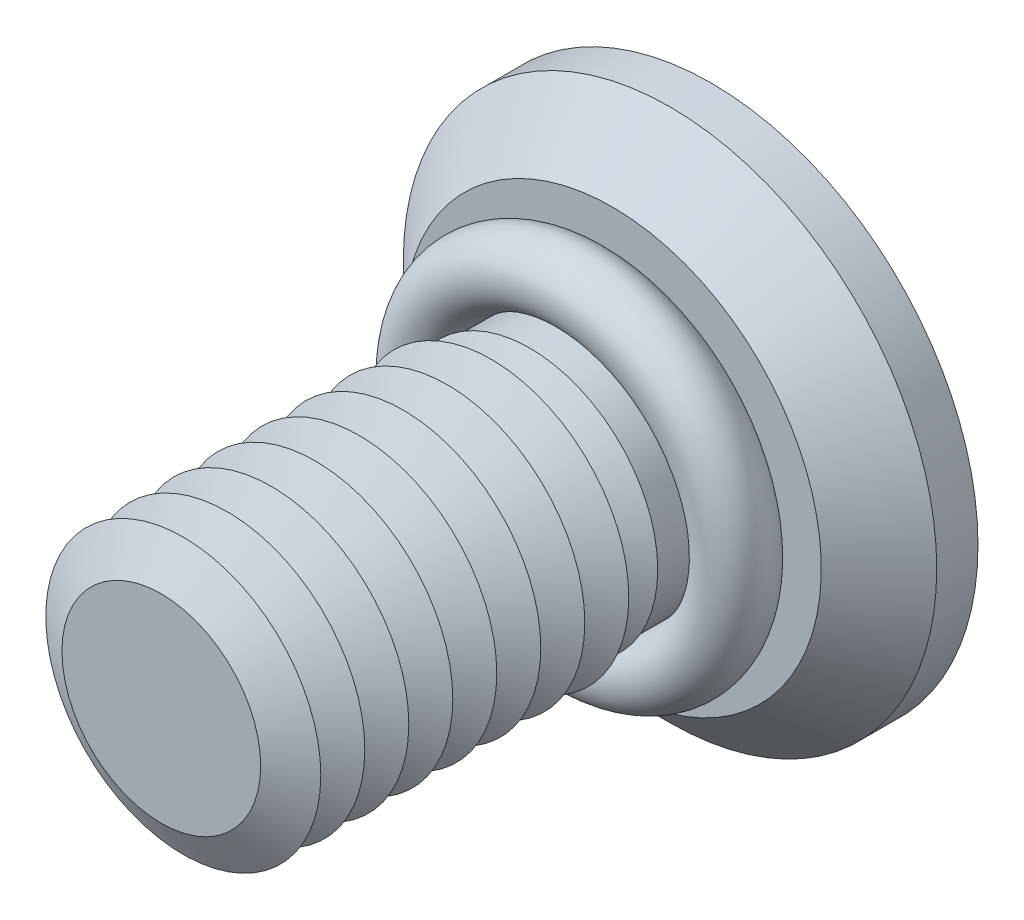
ISO-10303-21;
HEADER;
FILE_DESCRIPTION(('STEP AP214'),'2;1');
FILE_NAME('part.step','',(''),(''),'','','');
FILE_SCHEMA(('AUTOMOTIVE_DESIGN { 1 0 10303 214 1 1 1 1 }'));
ENDSEC;
DATA;
#1=APPLICATION_CONTEXT('core data for automotive mechanical design processes');
#2=APPLICATION_PROTOCOL_DEFINITION('international standard','automotive_design',2000,#1);
#3=PRODUCT_CONTEXT('',#1,'mechanical');
#4=PRODUCT('Part','Part','',(#3));
#5=PRODUCT_RELATED_PRODUCT_CATEGORY('part','',(#4));
#6=PRODUCT_DEFINITION_FORMATION('','',#4);
#7=PRODUCT_DEFINITION_CONTEXT('part definition',#1,'design');
#8=PRODUCT_DEFINITION('design','',#6,#7);
#9=PRODUCT_DEFINITION_SHAPE('','',#8);
#10=(LENGTH_UNIT() NAMED_UNIT(*) SI_UNIT(.MILLI.,.METRE.));
#11=(NAMED_UNIT(*) PLANE_ANGLE_UNIT() SI_UNIT($,.RADIAN.));
#12=(NAMED_UNIT(*) SI_UNIT($,.STERADIAN.) SOLID_ANGLE_UNIT());
#13=UNCERTAINTY_MEASURE_WITH_UNIT(LENGTH_MEASURE(1.E-05),#10,'distance_accuracy_value','');
#14=(GEOMETRIC_REPRESENTATION_CONTEXT(3) GLOBAL_UNCERTAINTY_ASSIGNED_CONTEXT((#13)) GLOBAL_UNIT_ASSIGNED_CONTEXT((#10,
#11,#12)) REPRESENTATION_CONTEXT('',''));
#15=CARTESIAN_POINT('',(0.,0.,0.));
#16=DIRECTION('',(0.,0.,1.));
#17=DIRECTION('',(1.,0.,0.));
#18=AXIS2_PLACEMENT_3D('',#15,#16,#17);
#19=CARTESIAN_POINT('',(0.,0.,2.4));
#20=DIRECTION('',(0.,0.,1.));
#21=DIRECTION('',(1.,0.,0.));
#22=AXIS2_PLACEMENT_3D('',#19,#20,#21);
#23=TOROIDAL_SURFACE('',#22,2.85,0.6);
#24=CARTESIAN_POINT('',(0.,2.85,2.4));
#25=DIRECTION('',(1.,0.,0.));
#26=DIRECTION('',(0.,0.,-1.));
#27=AXIS2_PLACEMENT_3D('',#24,#25,#26);
#28=CIRCLE('',#27,0.6);
#29=CARTESIAN_POINT('',(0.,3.45,2.4));
#30=VERTEX_POINT('',#29);
#31=EDGE_CURVE('P0_E10',#30,#30,#28,.T.);
#32=CARTESIAN_POINT('',(0.,0.,2.4));
#33=DIRECTION('',(0.,0.,1.));
#34=DIRECTION('',(1.,0.,0.));
#35=AXIS2_PLACEMENT_3D('',#32,#33,#34);
#36=CIRCLE('',#35,3.45);
#37=EDGE_CURVE('',#30,#30,#36,.T.);
#38=ORIENTED_EDGE('',*,*,#31,.F.);
#39=ORIENTED_EDGE('',*,*,#31,.T.);
#40=ORIENTED_EDGE('',*,*,#37,.T.);
#41=ORIENTED_EDGE('',*,*,#37,.F.);
#42=EDGE_LOOP('',(#38,#40,#39,#41));
#43=FACE_BOUND('',#42,.T.);
#44=ADVANCED_FACE('P0_F14',(#43),#23,.T.);
#45=CLOSED_SHELL('',(#44));
#46=MANIFOLD_SOLID_BREP('P0_B1',#45);
#47=CARTESIAN_POINT('',(0.,0.,6.));
#48=DIRECTION('',(0.,0.,-1.));
#49=DIRECTION('',(-1.,0.,0.));
#50=AXIS2_PLACEMENT_3D('',#47,#48,#49);
#51=CONICAL_SURFACE('',#50,1.80717967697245,1.0471975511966);
#52=CARTESIAN_POINT('',(0.,0.,5.6));
#53=DIRECTION('',(0.,0.,1.));
#54=DIRECTION('',(1.,0.,0.));
#55=AXIS2_PLACEMENT_3D('',#52,#53,#54);
#56=CIRCLE('',#55,2.5);
#57=CARTESIAN_POINT('',(2.5,0.,5.6));
#58=VERTEX_POINT('',#57);
#59=EDGE_CURVE('P1_E330',#58,#58,#56,.T.);
#60=ORIENTED_EDGE('',*,*,#59,.T.);
#61=EDGE_LOOP('',(#60));
#62=FACE_BOUND('',#61,.T.);
#63=CARTESIAN_POINT('',(0.,0.,6.));
#64=DIRECTION('',(0.,0.,1.));
#65=DIRECTION('',(1.,0.,0.));
#66=AXIS2_PLACEMENT_3D('',#63,#64,#65);
#67=CIRCLE('',#66,1.80717967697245);
#68=CARTESIAN_POINT('',(1.80717967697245,0.,6.));
#69=VERTEX_POINT('',#68);
#70=EDGE_CURVE('P1_E327',#69,#69,#67,.T.);
#71=ORIENTED_EDGE('',*,*,#70,.F.);
#72=EDGE_LOOP('',(#71));
#73=FACE_BOUND('',#72,.T.);
#74=ADVANCED_FACE('P1_F15',(#62,#73),#51,.T.);
#75=CARTESIAN_POINT('',(0.,0.,6.4));
#76=DIRECTION('',(0.,0.,1.));
#77=DIRECTION('',(1.,0.,0.));
#78=AXIS2_PLACEMENT_3D('',#75,#76,#77);
#79=CONICAL_SURFACE('',#78,2.5,1.0471975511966);
#80=ORIENTED_EDGE('',*,*,#70,.T.);
#81=EDGE_LOOP('',(#80));
#82=FACE_BOUND('',#81,.T.);
#83=CARTESIAN_POINT('',(0.,0.,6.4));
#84=DIRECTION('',(0.,0.,1.));
#85=DIRECTION('',(1.,0.,0.));
#86=AXIS2_PLACEMENT_3D('',#83,#84,#85);
#87=CIRCLE('',#86,2.5);
#88=CARTESIAN_POINT('',(2.5,0.,6.4));
#89=VERTEX_POINT('',#88);
#90=EDGE_CURVE('P1_E324',#89,#89,#87,.T.);
#91=ORIENTED_EDGE('',*,*,#90,.F.);
#92=EDGE_LOOP('',(#91));
#93=FACE_BOUND('',#92,.T.);
#94=ADVANCED_FACE('P1_F249',(#82,#93),#79,.T.);
#95=CARTESIAN_POINT('',(0.,0.,10.));
#96=DIRECTION('',(0.,0.,1.));
#97=DIRECTION('',(1.,0.,0.));
#98=AXIS2_PLACEMENT_3D('',#95,#96,#97);
#99=PLANE('',#98);
#100=CARTESIAN_POINT('',(0.,0.,10.));
#101=DIRECTION('',(0.,0.,1.));
#102=DIRECTION('',(1.,0.,0.));
#103=AXIS2_PLACEMENT_3D('',#100,#101,#102);
#104=CIRCLE('',#103,1.80717967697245);
#105=CARTESIAN_POINT('',(1.80717967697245,0.,10.));
#106=VERTEX_POINT('',#105);
#107=EDGE_CURVE('P1_E131',#106,#106,#104,.T.);
#108=ORIENTED_EDGE('',*,*,#107,.T.);
#109=EDGE_LOOP('',(#108));
#110=FACE_BOUND('',#109,.T.);
#111=ADVANCED_FACE('P1_F257',(#110),#99,.T.);
#112=CARTESIAN_POINT('',(0.,0.,10.));
#113=DIRECTION('',(0.,0.,-1.));
#114=DIRECTION('',(-1.,0.,0.));
#115=AXIS2_PLACEMENT_3D('',#112,#113,#114);
#116=CONICAL_SURFACE('',#115,1.80717967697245,1.0471975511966);
#117=CARTESIAN_POINT('',(0.,0.,9.6));
#118=DIRECTION('',(0.,0.,1.));
#119=DIRECTION('',(1.,0.,0.));
#120=AXIS2_PLACEMENT_3D('',#117,#118,#119);
#121=CIRCLE('',#120,2.5);
#122=CARTESIAN_POINT('',(2.5,0.,9.6));
#123=VERTEX_POINT('',#122);
#124=EDGE_CURVE('P1_E133',#123,#123,#121,.T.);
#125=ORIENTED_EDGE('',*,*,#124,.T.);
#126=EDGE_LOOP('',(#125));
#127=FACE_BOUND('',#126,.T.);
#128=ORIENTED_EDGE('',*,*,#107,.F.);
#129=EDGE_LOOP('',(#128));
#130=FACE_BOUND('',#129,.T.);
#131=ADVANCED_FACE('P1_F199',(#127,#130),#116,.T.);
#132=CARTESIAN_POINT('',(0.,0.,9.6));
#133=DIRECTION('',(0.,0.,1.));
#134=DIRECTION('',(1.,0.,0.));
#135=AXIS2_PLACEMENT_3D('',#132,#133,#134);
#136=CONICAL_SURFACE('',#135,2.5,1.0471975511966);
#137=CARTESIAN_POINT('',(0.,0.,9.2));
#138=DIRECTION('',(0.,0.,1.));
#139=DIRECTION('',(1.,0.,0.));
#140=AXIS2_PLACEMENT_3D('',#137,#138,#139);
#141=CIRCLE('',#140,1.80717967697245);
#142=CARTESIAN_POINT('',(1.80717967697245,0.,9.2));
#143=VERTEX_POINT('',#142);
#144=EDGE_CURVE('P1_E303',#143,#143,#141,.T.);
#145=ORIENTED_EDGE('',*,*,#144,.T.);
#146=EDGE_LOOP('',(#145));
#147=FACE_BOUND('',#146,.T.);
#148=ORIENTED_EDGE('',*,*,#124,.F.);
#149=EDGE_LOOP('',(#148));
#150=FACE_BOUND('',#149,.T.);
#151=ADVANCED_FACE('P1_F290',(#147,#150),#136,.T.);
#152=CARTESIAN_POINT('',(0.,0.,9.2));
#153=DIRECTION('',(0.,0.,-1.));
#154=DIRECTION('',(-1.,0.,0.));
#155=AXIS2_PLACEMENT_3D('',#152,#153,#154);
#156=CONICAL_SURFACE('',#155,1.80717967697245,1.0471975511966);
#157=CARTESIAN_POINT('',(0.,0.,8.8));
#158=DIRECTION('',(0.,0.,1.));
#159=DIRECTION('',(1.,0.,0.));
#160=AXIS2_PLACEMENT_3D('',#157,#158,#159);
#161=CIRCLE('',#160,2.5);
#162=CARTESIAN_POINT('',(2.5,0.,8.8));
#163=VERTEX_POINT('',#162);
#164=EDGE_CURVE('P1_E300',#163,#163,#161,.T.);
#165=ORIENTED_EDGE('',*,*,#164,.T.);
#166=EDGE_LOOP('',(#165));
#167=FACE_BOUND('',#166,.T.);
#168=ORIENTED_EDGE('',*,*,#144,.F.);
#169=EDGE_LOOP('',(#168));
#170=FACE_BOUND('',#169,.T.);
#171=ADVANCED_FACE('P1_F285',(#167,#170),#156,.T.);
#172=CARTESIAN_POINT('',(0.,0.,8.8));
#173=DIRECTION('',(0.,0.,1.));
#174=DIRECTION('',(1.,0.,0.));
#175=AXIS2_PLACEMENT_3D('',#172,#173,#174);
#176=CONICAL_SURFACE('',#175,2.5,1.0471975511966);
#177=CARTESIAN_POINT('',(0.,0.,8.4));
#178=DIRECTION('',(0.,0.,1.));
#179=DIRECTION('',(1.,0.,0.));
#180=AXIS2_PLACEMENT_3D('',#177,#178,#179);
#181=CIRCLE('',#180,1.80717967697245);
#182=CARTESIAN_POINT('',(1.80717967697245,0.,8.4));
#183=VERTEX_POINT('',#182);
#184=EDGE_CURVE('P1_E307',#183,#183,#181,.T.);
#185=ORIENTED_EDGE('',*,*,#184,.T.);
#186=EDGE_LOOP('',(#185));
#187=FACE_BOUND('',#186,.T.);
#188=ORIENTED_EDGE('',*,*,#164,.F.);
#189=EDGE_LOOP('',(#188));
#190=FACE_BOUND('',#189,.T.);
#191=ADVANCED_FACE('P1_F282',(#187,#190),#176,.T.);
#192=CARTESIAN_POINT('',(0.,0.,8.4));
#193=DIRECTION('',(0.,0.,-1.));
#194=DIRECTION('',(-1.,0.,0.));
#195=AXIS2_PLACEMENT_3D('',#192,#193,#194);
#196=CONICAL_SURFACE('',#195,1.80717967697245,1.0471975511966);
#197=CARTESIAN_POINT('',(0.,0.,8.));
#198=DIRECTION('',(0.,0.,1.));
#199=DIRECTION('',(1.,0.,0.));
#200=AXIS2_PLACEMENT_3D('',#197,#198,#199);
#201=CIRCLE('',#200,2.5);
#202=CARTESIAN_POINT('',(2.5,0.,8.));
#203=VERTEX_POINT('',#202);
#204=EDGE_CURVE('P1_E312',#203,#203,#201,.T.);
#205=ORIENTED_EDGE('',*,*,#204,.T.);
#206=EDGE_LOOP('',(#205));
#207=FACE_BOUND('',#206,.T.);
#208=ORIENTED_EDGE('',*,*,#184,.F.);
#209=EDGE_LOOP('',(#208));
#210=FACE_BOUND('',#209,.T.);
#211=ADVANCED_FACE('P1_F277',(#207,#210),#196,.T.);
#212=CARTESIAN_POINT('',(0.,0.,8.));
#213=DIRECTION('',(0.,0.,1.));
#214=DIRECTION('',(1.,0.,0.));
#215=AXIS2_PLACEMENT_3D('',#212,#213,#214);
#216=CONICAL_SURFACE('',#215,2.5,1.0471975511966);
#217=CARTESIAN_POINT('',(0.,0.,7.6));
#218=DIRECTION('',(0.,0.,1.));
#219=DIRECTION('',(1.,0.,0.));
#220=AXIS2_PLACEMENT_3D('',#217,#218,#219);
#221=CIRCLE('',#220,1.80717967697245);
#222=CARTESIAN_POINT('',(1.80717967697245,0.,7.6));
#223=VERTEX_POINT('',#222);
#224=EDGE_CURVE('P1_E315',#223,#223,#221,.T.);
#225=ORIENTED_EDGE('',*,*,#224,.T.);
#226=EDGE_LOOP('',(#225));
#227=FACE_BOUND('',#226,.T.);
#228=ORIENTED_EDGE('',*,*,#204,.F.);
#229=EDGE_LOOP('',(#228));
#230=FACE_BOUND('',#229,.T.);
#231=ADVANCED_FACE('P1_F274',(#227,#230),#216,.T.);
#232=CARTESIAN_POINT('',(0.,0.,7.6));
#233=DIRECTION('',(0.,0.,-1.));
#234=DIRECTION('',(-1.,0.,0.));
#235=AXIS2_PLACEMENT_3D('',#232,#233,#234);
#236=CONICAL_SURFACE('',#235,1.80717967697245,1.0471975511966);
#237=CARTESIAN_POINT('',(0.,0.,7.2));
#238=DIRECTION('',(0.,0.,1.));
#239=DIRECTION('',(1.,0.,0.));
#240=AXIS2_PLACEMENT_3D('',#237,#238,#239);
#241=CIRCLE('',#240,2.5);
#242=CARTESIAN_POINT('',(2.5,0.,7.2));
#243=VERTEX_POINT('',#242);
#244=EDGE_CURVE('P1_E318',#243,#243,#241,.T.);
#245=ORIENTED_EDGE('',*,*,#244,.T.);
#246=EDGE_LOOP('',(#245));
#247=FACE_BOUND('',#246,.T.);
#248=ORIENTED_EDGE('',*,*,#224,.F.);
#249=EDGE_LOOP('',(#248));
#250=FACE_BOUND('',#249,.T.);
#251=ADVANCED_FACE('P1_F268',(#247,#250),#236,.T.);
#252=CARTESIAN_POINT('',(0.,0.,7.2));
#253=DIRECTION('',(0.,0.,1.));
#254=DIRECTION('',(1.,0.,0.));
#255=AXIS2_PLACEMENT_3D('',#252,#253,#254);
#256=CONICAL_SURFACE('',#255,2.5,1.0471975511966);
#257=CARTESIAN_POINT('',(0.,0.,6.8));
#258=DIRECTION('',(0.,0.,1.));
#259=DIRECTION('',(1.,0.,0.));
#260=AXIS2_PLACEMENT_3D('',#257,#258,#259);
#261=CIRCLE('',#260,1.80717967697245);
#262=CARTESIAN_POINT('',(1.80717967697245,0.,6.8));
#263=VERTEX_POINT('',#262);
#264=EDGE_CURVE('P1_E321',#263,#263,#261,.T.);
#265=ORIENTED_EDGE('',*,*,#264,.T.);
#266=EDGE_LOOP('',(#265));
#267=FACE_BOUND('',#266,.T.);
#268=ORIENTED_EDGE('',*,*,#244,.F.);
#269=EDGE_LOOP('',(#268));
#270=FACE_BOUND('',#269,.T.);
#271=ADVANCED_FACE('P1_F264',(#267,#270),#256,.T.);
#272=CARTESIAN_POINT('',(0.,0.,6.8));
#273=DIRECTION('',(0.,0.,-1.));
#274=DIRECTION('',(-1.,0.,0.));
#275=AXIS2_PLACEMENT_3D('',#272,#273,#274);
#276=CONICAL_SURFACE('',#275,1.80717967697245,1.0471975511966);
#277=ORIENTED_EDGE('',*,*,#90,.T.);
#278=EDGE_LOOP('',(#277));
#279=FACE_BOUND('',#278,.T.);
#280=ORIENTED_EDGE('',*,*,#264,.F.);
#281=EDGE_LOOP('',(#280));
#282=FACE_BOUND('',#281,.T.);
#283=ADVANCED_FACE('P1_F267',(#279,#282),#276,.T.);
#284=CARTESIAN_POINT('',(0.,0.,5.2));
#285=DIRECTION('',(0.,0.,-1.));
#286=DIRECTION('',(-1.,0.,0.));
#287=AXIS2_PLACEMENT_3D('',#284,#285,#286);
#288=CONICAL_SURFACE('',#287,1.80717967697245,1.0471975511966);
#289=CARTESIAN_POINT('',(0.,0.,4.8));
#290=DIRECTION('',(0.,0.,1.));
#291=DIRECTION('',(1.,0.,0.));
#292=AXIS2_PLACEMENT_3D('',#289,#290,#291);
#293=CIRCLE('',#292,2.5);
#294=CARTESIAN_POINT('',(2.5,0.,4.8));
#295=VERTEX_POINT('',#294);
#296=EDGE_CURVE('P1_E335',#295,#295,#293,.T.);
#297=ORIENTED_EDGE('',*,*,#296,.T.);
#298=EDGE_LOOP('',(#297));
#299=FACE_BOUND('',#298,.T.);
#300=CARTESIAN_POINT('',(0.,0.,5.2));
#301=DIRECTION('',(0.,0.,1.));
#302=DIRECTION('',(1.,0.,0.));
#303=AXIS2_PLACEMENT_3D('',#300,#301,#302);
#304=CIRCLE('',#303,1.80717967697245);
#305=CARTESIAN_POINT('',(1.80717967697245,0.,5.2));
#306=VERTEX_POINT('',#305);
#307=EDGE_CURVE('P1_E332',#306,#306,#304,.T.);
#308=ORIENTED_EDGE('',*,*,#307,.F.);
#309=EDGE_LOOP('',(#308));
#310=FACE_BOUND('',#309,.T.);
#311=ADVANCED_FACE('P1_F272',(#299,#310),#288,.T.);
#312=CARTESIAN_POINT('',(0.,0.,5.6));
#313=DIRECTION('',(0.,0.,1.));
#314=DIRECTION('',(1.,0.,0.));
#315=AXIS2_PLACEMENT_3D('',#312,#313,#314);
#316=CONICAL_SURFACE('',#315,2.5,1.0471975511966);
#317=ORIENTED_EDGE('',*,*,#307,.T.);
#318=EDGE_LOOP('',(#317));
#319=FACE_BOUND('',#318,.T.);
#320=ORIENTED_EDGE('',*,*,#59,.F.);
#321=EDGE_LOOP('',(#320));
#322=FACE_BOUND('',#321,.T.);
#323=ADVANCED_FACE('P1_F451',(#319,#322),#316,.T.);
#324=CARTESIAN_POINT('',(0.,0.,4.4));
#325=DIRECTION('',(0.,0.,-1.));
#326=DIRECTION('',(-1.,0.,0.));
#327=AXIS2_PLACEMENT_3D('',#324,#325,#326);
#328=CONICAL_SURFACE('',#327,1.80717967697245,1.0471975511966);
#329=CARTESIAN_POINT('',(0.,0.,4.));
#330=DIRECTION('',(0.,0.,1.));
#331=DIRECTION('',(1.,0.,0.));
#332=AXIS2_PLACEMENT_3D('',#329,#330,#331);
#333=CIRCLE('',#332,2.5);
#334=CARTESIAN_POINT('',(2.5,0.,4.));
#335=VERTEX_POINT('',#334);
#336=EDGE_CURVE('P1_E341',#335,#335,#333,.T.);
#337=ORIENTED_EDGE('',*,*,#336,.T.);
#338=EDGE_LOOP('',(#337));
#339=FACE_BOUND('',#338,.T.);
#340=CARTESIAN_POINT('',(0.,0.,4.4));
#341=DIRECTION('',(0.,0.,1.));
#342=DIRECTION('',(1.,0.,0.));
#343=AXIS2_PLACEMENT_3D('',#340,#341,#342);
#344=CIRCLE('',#343,1.80717967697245);
#345=CARTESIAN_POINT('',(1.80717967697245,0.,4.4));
#346=VERTEX_POINT('',#345);
#347=EDGE_CURVE('P1_E338',#346,#346,#344,.T.);
#348=ORIENTED_EDGE('',*,*,#347,.F.);
#349=EDGE_LOOP('',(#348));
#350=FACE_BOUND('',#349,.T.);
#351=ADVANCED_FACE('P1_F460',(#339,#350),#328,.T.);
#352=CARTESIAN_POINT('',(0.,0.,4.8));
#353=DIRECTION('',(0.,0.,1.));
#354=DIRECTION('',(1.,0.,0.));
#355=AXIS2_PLACEMENT_3D('',#352,#353,#354);
#356=CONICAL_SURFACE('',#355,2.5,1.0471975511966);
#357=ORIENTED_EDGE('',*,*,#347,.T.);
#358=EDGE_LOOP('',(#357));
#359=FACE_BOUND('',#358,.T.);
#360=ORIENTED_EDGE('',*,*,#296,.F.);
#361=EDGE_LOOP('',(#360));
#362=FACE_BOUND('',#361,.T.);
#363=ADVANCED_FACE('P1_F354',(#359,#362),#356,.T.);
#364=CARTESIAN_POINT('',(0.,0.,3.6));
#365=DIRECTION('',(0.,0.,-1.));
#366=DIRECTION('',(-1.,0.,0.));
#367=AXIS2_PLACEMENT_3D('',#364,#365,#366);
#368=CONICAL_SURFACE('',#367,1.80717967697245,1.0471975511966);
#369=CARTESIAN_POINT('',(0.,0.,3.6));
#370=DIRECTION('',(0.,0.,1.));
#371=DIRECTION('',(1.,0.,0.));
#372=AXIS2_PLACEMENT_3D('',#369,#370,#371);
#373=CIRCLE('',#372,1.80717967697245);
#374=CARTESIAN_POINT('',(1.80717967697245,0.,3.6));
#375=VERTEX_POINT('',#374);
#376=EDGE_CURVE('P1_E344',#375,#375,#373,.T.);
#377=ORIENTED_EDGE('',*,*,#376,.F.);
#378=EDGE_LOOP('',(#377));
#379=FACE_BOUND('',#378,.T.);
#380=CARTESIAN_POINT('',(0.,0.,3.3));
#381=DIRECTION('',(0.,0.,1.));
#382=DIRECTION('',(1.,0.,0.));
#383=AXIS2_PLACEMENT_3D('',#380,#381,#382);
#384=CIRCLE('',#383,2.32679491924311);
#385=CARTESIAN_POINT('',(2.32679491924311,0.,3.3));
#386=VERTEX_POINT('',#385);
#387=EDGE_CURVE('P1_E19',#386,#386,#384,.T.);
#388=ORIENTED_EDGE('',*,*,#387,.T.);
#389=EDGE_LOOP('',(#388));
#390=FACE_BOUND('',#389,.T.);
#391=ADVANCED_FACE('P1_F351',(#379,#390),#368,.T.);
#392=CARTESIAN_POINT('',(0.,0.,4.));
#393=DIRECTION('',(0.,0.,1.));
#394=DIRECTION('',(1.,0.,0.));
#395=AXIS2_PLACEMENT_3D('',#392,#393,#394);
#396=CONICAL_SURFACE('',#395,2.5,1.0471975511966);
#397=ORIENTED_EDGE('',*,*,#376,.T.);
#398=EDGE_LOOP('',(#397));
#399=FACE_BOUND('',#398,.T.);
#400=ORIENTED_EDGE('',*,*,#336,.F.);
#401=EDGE_LOOP('',(#400));
#402=FACE_BOUND('',#401,.T.);
#403=ADVANCED_FACE('P1_F348',(#399,#402),#396,.T.);
#404=CARTESIAN_POINT('',(0.,0.,2.));
#405=DIRECTION('',(0.,0.,-1.));
#406=DIRECTION('',(-1.,0.,0.));
#407=AXIS2_PLACEMENT_3D('',#404,#405,#406);
#408=CONICAL_SURFACE('',#407,1.5,1.0471975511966);
#409=CARTESIAN_POINT('',(0.,0.,2.86602540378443));
#410=VERTEX_POINT('',#409);
#411=VERTEX_LOOP('',#410);
#412=FACE_BOUND('',#411,.T.);
#413=CARTESIAN_POINT('',(0.,0.,2.));
#414=DIRECTION('',(0.,0.,-1.));
#415=DIRECTION('',(-1.,0.,0.));
#416=AXIS2_PLACEMENT_3D('',#413,#414,#415);
#417=CIRCLE('',#416,1.5);
#418=CARTESIAN_POINT('',(-1.5,0.,2.));
#419=VERTEX_POINT('',#418);
#420=CARTESIAN_POINT('',(-0.75,1.29903810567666,2.));
#421=VERTEX_POINT('',#420);
#422=EDGE_CURVE('P1_E117',#419,#421,#417,.T.);
#423=ORIENTED_EDGE('',*,*,#422,.T.);
#424=CARTESIAN_POINT('',(0.,0.,2.));
#425=DIRECTION('',(0.,0.,-1.));
#426=DIRECTION('',(-1.,0.,0.));
#427=AXIS2_PLACEMENT_3D('',#424,#425,#426);
#428=CIRCLE('',#427,1.5);
#429=CARTESIAN_POINT('',(0.75,1.29903810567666,2.));
#430=VERTEX_POINT('',#429);
#431=EDGE_CURVE('P1_E24',#421,#430,#428,.T.);
#432=ORIENTED_EDGE('',*,*,#431,.T.);
#433=CARTESIAN_POINT('',(1.5,0.,2.));
#434=VERTEX_POINT('',#433);
#435=EDGE_CURVE('P1_E704',#430,#434,#428,.T.);
#436=ORIENTED_EDGE('',*,*,#435,.T.);
#437=CARTESIAN_POINT('',(0.750000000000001,-1.29903810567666,2.));
#438=VERTEX_POINT('',#437);
#439=EDGE_CURVE('P1_E697',#434,#438,#428,.T.);
#440=ORIENTED_EDGE('',*,*,#439,.T.);
#441=CARTESIAN_POINT('',(-0.75,-1.29903810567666,2.));
#442=VERTEX_POINT('',#441);
#443=EDGE_CURVE('P1_E185',#438,#442,#428,.T.);
#444=ORIENTED_EDGE('',*,*,#443,.T.);
#445=EDGE_CURVE('P1_E182',#442,#419,#428,.T.);
#446=ORIENTED_EDGE('',*,*,#445,.T.);
#447=EDGE_LOOP('',(#423,#432,#436,#440,#444,#446));
#448=FACE_BOUND('',#447,.T.);
#449=ADVANCED_FACE('P1_F201',(#412,#448),#408,.F.);
#450=CARTESIAN_POINT('',(0.,0.,2.));
#451=DIRECTION('',(0.,0.,-1.));
#452=DIRECTION('',(-1.,0.,0.));
#453=AXIS2_PLACEMENT_3D('',#450,#451,#452);
#454=PLANE('',#453);
#455=ORIENTED_EDGE('',*,*,#443,.F.);
#456=DIRECTION('',(-0.866025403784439,-0.5,0.));
#457=VECTOR('',#456,1.);
#458=CARTESIAN_POINT('',(1.5,-0.866025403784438,2.));
#459=LINE('',#458,#457);
#460=CARTESIAN_POINT('',(0.,-1.73205080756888,2.));
#461=VERTEX_POINT('',#460);
#462=EDGE_CURVE('P1_E713',#438,#461,#459,.T.);
#463=ORIENTED_EDGE('',*,*,#462,.T.);
#464=DIRECTION('',(-0.866025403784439,0.5,0.));
#465=VECTOR('',#464,1.);
#466=CARTESIAN_POINT('',(0.,-1.73205080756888,2.));
#467=LINE('',#466,#465);
#468=EDGE_CURVE('P1_E720',#461,#442,#467,.T.);
#469=ORIENTED_EDGE('',*,*,#468,.T.);
#470=EDGE_LOOP('',(#455,#463,#469));
#471=FACE_BOUND('',#470,.T.);
#472=ADVANCED_FACE('P1_F502',(#471),#454,.T.);
#473=ORIENTED_EDGE('',*,*,#445,.F.);
#474=CARTESIAN_POINT('',(-1.5,-0.86602540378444,2.));
#475=VERTEX_POINT('',#474);
#476=EDGE_CURVE('P1_E723',#442,#475,#467,.T.);
#477=ORIENTED_EDGE('',*,*,#476,.T.);
#478=DIRECTION('',(0.,1.,0.));
#479=VECTOR('',#478,1.);
#480=CARTESIAN_POINT('',(-1.5,-0.86602540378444,2.));
#481=LINE('',#480,#479);
#482=EDGE_CURVE('P1_E123',#475,#419,#481,.T.);
#483=ORIENTED_EDGE('',*,*,#482,.T.);
#484=EDGE_LOOP('',(#473,#477,#483));
#485=FACE_BOUND('',#484,.T.);
#486=ADVANCED_FACE('P1_F234',(#485),#454,.T.);
#487=ORIENTED_EDGE('',*,*,#422,.F.);
#488=CARTESIAN_POINT('',(-1.5,0.866025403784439,2.));
#489=VERTEX_POINT('',#488);
#490=EDGE_CURVE('P1_E725',#419,#489,#481,.T.);
#491=ORIENTED_EDGE('',*,*,#490,.T.);
#492=DIRECTION('',(0.866025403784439,0.5,0.));
#493=VECTOR('',#492,1.);
#494=CARTESIAN_POINT('',(-1.5,0.866025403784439,2.));
#495=LINE('',#494,#493);
#496=EDGE_CURVE('P1_E728',#489,#421,#495,.T.);
#497=ORIENTED_EDGE('',*,*,#496,.T.);
#498=EDGE_LOOP('',(#487,#491,#497));
#499=FACE_BOUND('',#498,.T.);
#500=ADVANCED_FACE('P1_F519',(#499),#454,.T.);
#501=ORIENTED_EDGE('',*,*,#431,.F.);
#502=CARTESIAN_POINT('',(0.,1.73205080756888,2.));
#503=VERTEX_POINT('',#502);
#504=EDGE_CURVE('P1_E727',#421,#503,#495,.T.);
#505=ORIENTED_EDGE('',*,*,#504,.T.);
#506=DIRECTION('',(0.866025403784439,-0.5,0.));
#507=VECTOR('',#506,1.);
#508=CARTESIAN_POINT('',(0.,1.73205080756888,2.));
#509=LINE('',#508,#507);
#510=EDGE_CURVE('P1_E161',#503,#430,#509,.T.);
#511=ORIENTED_EDGE('',*,*,#510,.T.);
#512=EDGE_LOOP('',(#501,#505,#511));
#513=FACE_BOUND('',#512,.T.);
#514=ADVANCED_FACE('P1_F527',(#513),#454,.T.);
#515=ORIENTED_EDGE('',*,*,#435,.F.);
#516=CARTESIAN_POINT('',(1.5,0.866025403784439,2.));
#517=VERTEX_POINT('',#516);
#518=EDGE_CURVE('P1_E712',#430,#517,#509,.T.);
#519=ORIENTED_EDGE('',*,*,#518,.T.);
#520=DIRECTION('',(0.,-1.,0.));
#521=VECTOR('',#520,1.);
#522=CARTESIAN_POINT('',(1.5,0.866025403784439,2.));
#523=LINE('',#522,#521);
#524=EDGE_CURVE('P1_E707',#517,#434,#523,.T.);
#525=ORIENTED_EDGE('',*,*,#524,.T.);
#526=EDGE_LOOP('',(#515,#519,#525));
#527=FACE_BOUND('',#526,.T.);
#528=ADVANCED_FACE('P1_F536',(#527),#454,.T.);
#529=ORIENTED_EDGE('',*,*,#439,.F.);
#530=CARTESIAN_POINT('',(1.5,-0.866025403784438,2.));
#531=VERTEX_POINT('',#530);
#532=EDGE_CURVE('P1_E699',#434,#531,#523,.T.);
#533=ORIENTED_EDGE('',*,*,#532,.T.);
#534=EDGE_CURVE('P1_E125',#531,#438,#459,.T.);
#535=ORIENTED_EDGE('',*,*,#534,.T.);
#536=EDGE_LOOP('',(#529,#533,#535));
#537=FACE_BOUND('',#536,.T.);
#538=ADVANCED_FACE('P1_F232',(#537),#454,.T.);
#539=CARTESIAN_POINT('',(1.5,-0.866025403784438,2.));
#540=DIRECTION('',(0.5,-0.866025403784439,0.));
#541=DIRECTION('',(0.866025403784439,0.5,0.));
#542=AXIS2_PLACEMENT_3D('',#539,#540,#541);
#543=PLANE('',#542);
#544=DIRECTION('',(0.,0.,-1.));
#545=VECTOR('',#544,1.);
#546=CARTESIAN_POINT('',(1.5,-0.866025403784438,2.));
#547=LINE('',#546,#545);
#548=CARTESIAN_POINT('',(1.5,-0.866025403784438,0.));
#549=VERTEX_POINT('',#548);
#550=EDGE_CURVE('P1_E164',#531,#549,#547,.T.);
#551=ORIENTED_EDGE('',*,*,#550,.T.);
#552=CARTESIAN_POINT('',(1.5002,-0.865909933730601,-3.09432014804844E-05));
#553=CARTESIAN_POINT('',(1.43789222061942,-0.901883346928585,0.00961367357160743));
#554=CARTESIAN_POINT('',(1.37547144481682,-0.937921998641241,0.0183695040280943));
#555=CARTESIAN_POINT('',(1.25040937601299,-1.01012661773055,0.0337528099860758));
#556=CARTESIAN_POINT('',(1.18776800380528,-1.04629263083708,0.0403794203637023));
#557=CARTESIAN_POINT('',(1.06264466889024,-1.11853262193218,0.0511173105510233));
#558=CARTESIAN_POINT('',(1.00016355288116,-1.15460611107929,0.0552413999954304));
#559=CARTESIAN_POINT('',(0.875121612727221,-1.22679910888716,0.0607713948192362));
#560=CARTESIAN_POINT('',(0.812560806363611,-1.26291860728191,0.0621778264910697));
#561=CARTESIAN_POINT('',(0.68743919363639,-1.33515760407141,0.0621778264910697));
#562=CARTESIAN_POINT('',(0.62487838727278,-1.37127710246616,0.0607713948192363));
#563=CARTESIAN_POINT('',(0.49983644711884,-1.44347010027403,0.0552413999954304));
#564=CARTESIAN_POINT('',(0.437355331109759,-1.47954358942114,0.0511173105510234));
#565=CARTESIAN_POINT('',(0.312231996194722,-1.55178358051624,0.0403794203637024));
#566=CARTESIAN_POINT('',(0.249590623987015,-1.58794959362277,0.0337528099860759));
#567=CARTESIAN_POINT('',(0.124528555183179,-1.66015421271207,0.0183695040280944));
#568=CARTESIAN_POINT('',(0.0621077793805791,-1.69619286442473,0.00961367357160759));
#569=CARTESIAN_POINT('',(-0.000199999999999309,-1.73216627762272,-3.09432014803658E-05));
#570=B_SPLINE_CURVE_WITH_KNOTS('',3,(#552,#553,#554,#555,#556,#557,#558,#559,#560,#561,#562,
#563,#564,#565,#566,#567,#568,#569),.UNSPECIFIED.,.F.,.F.,(4,2,2,2,2,2,2,2,4),(0.,
0.217782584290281,0.435653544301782,0.652399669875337,0.869103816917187,1.08580796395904,
1.30255408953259,1.52042504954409,1.73820763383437),.UNSPECIFIED.);
#571=CARTESIAN_POINT('',(0.,-1.73205080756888,0.));
#572=VERTEX_POINT('',#571);
#573=EDGE_CURVE('P1_E118',#549,#572,#570,.T.);
#574=ORIENTED_EDGE('',*,*,#573,.T.);
#575=DIRECTION('',(0.,0.,-1.));
#576=VECTOR('',#575,1.);
#577=CARTESIAN_POINT('',(0.,-1.73205080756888,2.));
#578=LINE('',#577,#576);
#579=EDGE_CURVE('P1_E116',#461,#572,#578,.T.);
#580=ORIENTED_EDGE('',*,*,#579,.F.);
#581=ORIENTED_EDGE('',*,*,#462,.F.);
#582=ORIENTED_EDGE('',*,*,#534,.F.);
#583=EDGE_LOOP('',(#551,#574,#580,#581,#582));
#584=FACE_BOUND('',#583,.T.);
#585=ADVANCED_FACE('P1_F229',(#584),#543,.F.);
#586=CARTESIAN_POINT('',(0.,-1.73205080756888,2.));
#587=DIRECTION('',(-0.5,-0.866025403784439,0.));
#588=DIRECTION('',(0.866025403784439,-0.5,0.));
#589=AXIS2_PLACEMENT_3D('',#586,#587,#588);
#590=PLANE('',#589);
#591=ORIENTED_EDGE('',*,*,#579,.T.);
#592=CARTESIAN_POINT('',(0.000200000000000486,-1.73216627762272,-3.09432014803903E-05));
#593=CARTESIAN_POINT('',(-0.0621077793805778,-1.69619286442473,0.00961367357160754));
#594=CARTESIAN_POINT('',(-0.124528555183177,-1.66015421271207,0.0183695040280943));
#595=CARTESIAN_POINT('',(-0.249590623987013,-1.58794959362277,0.0337528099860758));
#596=CARTESIAN_POINT('',(-0.312231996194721,-1.55178358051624,0.0403794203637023));
#597=CARTESIAN_POINT('',(-0.437355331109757,-1.47954358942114,0.0511173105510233));
#598=CARTESIAN_POINT('',(-0.499836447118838,-1.44347010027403,0.0552413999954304));
#599=CARTESIAN_POINT('',(-0.624878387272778,-1.37127710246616,0.0607713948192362));
#600=CARTESIAN_POINT('',(-0.687439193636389,-1.33515760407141,0.0621778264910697));
#601=CARTESIAN_POINT('',(-0.81256080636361,-1.26291860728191,0.0621778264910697));
#602=CARTESIAN_POINT('',(-0.87512161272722,-1.22679910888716,0.0607713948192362));
#603=CARTESIAN_POINT('',(-1.00016355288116,-1.15460611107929,0.0552413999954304));
#604=CARTESIAN_POINT('',(-1.06264466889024,-1.11853262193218,0.0511173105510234));
#605=CARTESIAN_POINT('',(-1.18776800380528,-1.04629263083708,0.0403794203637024));
#606=CARTESIAN_POINT('',(-1.25040937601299,-1.01012661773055,0.0337528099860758));
#607=CARTESIAN_POINT('',(-1.37547144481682,-0.937921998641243,0.0183695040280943));
#608=CARTESIAN_POINT('',(-1.43789222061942,-0.901883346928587,0.00961367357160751));
#609=CARTESIAN_POINT('',(-1.5002,-0.865909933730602,-3.09432014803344E-05));
#610=B_SPLINE_CURVE_WITH_KNOTS('',3,(#592,#593,#594,#595,#596,#597,#598,#599,#600,#601,#602,
#603,#604,#605,#606,#607,#608,#609),.UNSPECIFIED.,.F.,.F.,(4,2,2,2,2,2,2,2,4),(0.,
0.217782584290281,0.435653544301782,0.652399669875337,0.869103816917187,1.08580796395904,
1.30255408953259,1.52042504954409,1.73820763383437),.UNSPECIFIED.);
#611=CARTESIAN_POINT('',(-1.5,-0.86602540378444,0.));
#612=VERTEX_POINT('',#611);
#613=EDGE_CURVE('P1_E94',#572,#612,#610,.T.);
#614=ORIENTED_EDGE('',*,*,#613,.T.);
#615=DIRECTION('',(0.,0.,-1.));
#616=VECTOR('',#615,1.);
#617=CARTESIAN_POINT('',(-1.5,-0.86602540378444,2.));
#618=LINE('',#617,#616);
#619=EDGE_CURVE('P1_E112',#475,#612,#618,.T.);
#620=ORIENTED_EDGE('',*,*,#619,.F.);
#621=ORIENTED_EDGE('',*,*,#476,.F.);
#622=ORIENTED_EDGE('',*,*,#468,.F.);
#623=EDGE_LOOP('',(#591,#614,#620,#621,#622));
#624=FACE_BOUND('',#623,.T.);
#625=ADVANCED_FACE('P1_F110',(#624),#590,.F.);
#626=CARTESIAN_POINT('',(-1.5,-0.86602540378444,2.));
#627=DIRECTION('',(-1.,0.,0.));
#628=DIRECTION('',(0.,-1.,0.));
#629=AXIS2_PLACEMENT_3D('',#626,#627,#628);
#630=PLANE('',#629);
#631=ORIENTED_EDGE('',*,*,#619,.T.);
#632=CARTESIAN_POINT('',(-1.5,-2.26080568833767,-0.262887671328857));
#633=CARTESIAN_POINT('',(-1.5,-2.19307335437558,-0.247767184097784));
#634=CARTESIAN_POINT('',(-1.5,-2.12529797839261,-0.232839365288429));
#635=CARTESIAN_POINT('',(-1.5,-1.989639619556,-0.203466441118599));
#636=CARTESIAN_POINT('',(-1.5,-1.92175663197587,-0.189021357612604));
#637=CARTESIAN_POINT('',(-1.5,-1.71778516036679,-0.146529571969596));
#638=CARTESIAN_POINT('',(-1.5,-1.58151166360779,-0.119357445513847));
#639=CARTESIAN_POINT('',(-1.5,-1.30947840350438,-0.0687885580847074));
#640=CARTESIAN_POINT('',(-1.5,-1.17372447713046,-0.0453610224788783));
#641=CARTESIAN_POINT('',(-1.5,-0.901404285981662,-0.0038503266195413));
#642=CARTESIAN_POINT('',(-1.5,-0.764838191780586,0.0142339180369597));
#643=CARTESIAN_POINT('',(-1.5,-0.489293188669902,0.0427079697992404));
#644=CARTESIAN_POINT('',(-1.5,-0.350304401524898,0.0530091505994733));
#645=CARTESIAN_POINT('',(-1.5,-0.141571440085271,0.0608183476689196));
#646=CARTESIAN_POINT('',(-1.5,-0.0719628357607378,0.0621480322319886));
#647=CARTESIAN_POINT('',(-1.5,0.0672555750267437,0.0622066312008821));
#648=CARTESIAN_POINT('',(-1.5,0.136865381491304,0.0609355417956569));
#649=CARTESIAN_POINT('',(-1.5,0.346114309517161,0.0532774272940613));
#650=CARTESIAN_POINT('',(-1.5,0.485619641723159,0.0430252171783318));
#651=CARTESIAN_POINT('',(-1.5,0.763829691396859,0.0143998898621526));
#652=CARTESIAN_POINT('',(-1.5,0.902533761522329,-0.0039790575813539));
#653=CARTESIAN_POINT('',(-1.5,1.18270277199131,-0.046775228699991));
#654=CARTESIAN_POINT('',(-1.5,1.32414472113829,-0.0713381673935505));
#655=CARTESIAN_POINT('',(-1.5,1.60634089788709,-0.124177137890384));
#656=CARTESIAN_POINT('',(-1.5,1.74709501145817,-0.152453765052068));
#657=CARTESIAN_POINT('',(-1.5,2.0281352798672,-0.21141289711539));
#658=CARTESIAN_POINT('',(-1.5,2.16842128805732,-0.242096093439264));
#659=CARTESIAN_POINT('',(-1.5,2.44863558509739,-0.305057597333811));
#660=CARTESIAN_POINT('',(-1.5,2.5885638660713,-0.337335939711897));
#661=CARTESIAN_POINT('',(-1.5,2.86645602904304,-0.402586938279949));
#662=CARTESIAN_POINT('',(-1.5,3.0044230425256,-0.435546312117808));
#663=CARTESIAN_POINT('',(-1.5,3.28017563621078,-0.502227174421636));
#664=CARTESIAN_POINT('',(-1.5,3.41796121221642,-0.535948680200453));
#665=CARTESIAN_POINT('',(-1.5,3.69320305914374,-0.603899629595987));
#666=CARTESIAN_POINT('',(-1.5,3.83065952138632,-0.638128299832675));
#667=CARTESIAN_POINT('',(-1.5,4.10546119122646,-0.707008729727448));
#668=CARTESIAN_POINT('',(-1.5,4.24280640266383,-0.741660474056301));
#669=CARTESIAN_POINT('',(-1.5,4.38011382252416,-0.776459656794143));
#670=B_SPLINE_CURVE_WITH_KNOTS('',3,(#632,#633,#634,#635,#636,#637,#638,#639,#640,#641,#642,
#643,#644,#645,#646,#647,#648,#649,#650,#651,#652,#653,#654,#655,#656,#657,#658,#659,#660,#661,
#662,#663,#664,#665,#666,#667,#668,#669),.UNSPECIFIED.,.F.,.F.,(4,2,2,2,2,2,2,2,2,2,2,2,2,2,2,2,
2,2,4),(0.,0.208198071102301,0.416405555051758,0.833243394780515,1.2464565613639,
1.65958581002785,2.07735129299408,2.28617008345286,2.49498917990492,2.91428402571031,
3.33388016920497,3.76448033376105,4.19514961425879,4.62594308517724,5.05674596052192,
5.48229088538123,5.90784548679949,6.33280701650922,6.75775319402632),.UNSPECIFIED.);
#671=CARTESIAN_POINT('',(-1.5,0.866025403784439,0.));
#672=VERTEX_POINT('',#671);
#673=EDGE_CURVE('P1_E10',#612,#672,#670,.T.);
#674=ORIENTED_EDGE('',*,*,#673,.T.);
#675=DIRECTION('',(0.,0.,-1.));
#676=VECTOR('',#675,1.);
#677=CARTESIAN_POINT('',(-1.5,0.866025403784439,2.));
#678=LINE('',#677,#676);
#679=EDGE_CURVE('P1_E124',#489,#672,#678,.T.);
#680=ORIENTED_EDGE('',*,*,#679,.F.);
#681=ORIENTED_EDGE('',*,*,#490,.F.);
#682=ORIENTED_EDGE('',*,*,#482,.F.);
#683=EDGE_LOOP('',(#631,#674,#680,#681,#682));
#684=FACE_BOUND('',#683,.T.);
#685=ADVANCED_FACE('P1_F120',(#684),#630,.F.);
#686=CARTESIAN_POINT('',(-1.5,0.866025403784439,2.));
#687=DIRECTION('',(-0.5,0.866025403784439,0.));
#688=DIRECTION('',(-0.866025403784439,-0.5,0.));
#689=AXIS2_PLACEMENT_3D('',#686,#687,#688);
#690=PLANE('',#689);
#691=ORIENTED_EDGE('',*,*,#679,.T.);
#692=CARTESIAN_POINT('',(-1.5002,0.865909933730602,-3.09432014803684E-05));
#693=CARTESIAN_POINT('',(-1.43789222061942,0.901883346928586,0.00961367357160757));
#694=CARTESIAN_POINT('',(-1.37547144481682,0.937921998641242,0.0183695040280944));
#695=CARTESIAN_POINT('',(-1.25040937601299,1.01012661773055,0.0337528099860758));
#696=CARTESIAN_POINT('',(-1.18776800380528,1.04629263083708,0.0403794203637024));
#697=CARTESIAN_POINT('',(-1.06264466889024,1.11853262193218,0.0511173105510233));
#698=CARTESIAN_POINT('',(-1.00016355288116,1.15460611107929,0.0552413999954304));
#699=CARTESIAN_POINT('',(-0.875121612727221,1.22679910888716,0.0607713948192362));
#700=CARTESIAN_POINT('',(-0.81256080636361,1.26291860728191,0.0621778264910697));
#701=CARTESIAN_POINT('',(-0.687439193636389,1.33515760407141,0.0621778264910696));
#702=CARTESIAN_POINT('',(-0.624878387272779,1.37127710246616,0.0607713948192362));
#703=CARTESIAN_POINT('',(-0.499836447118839,1.44347010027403,0.0552413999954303));
#704=CARTESIAN_POINT('',(-0.437355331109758,1.47954358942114,0.0511173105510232));
#705=CARTESIAN_POINT('',(-0.312231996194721,1.55178358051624,0.0403794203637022));
#706=CARTESIAN_POINT('',(-0.249590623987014,1.58794959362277,0.0337528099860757));
#707=CARTESIAN_POINT('',(-0.124528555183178,1.66015421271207,0.0183695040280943));
#708=CARTESIAN_POINT('',(-0.0621077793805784,1.69619286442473,0.00961367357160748));
#709=CARTESIAN_POINT('',(0.000199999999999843,1.73216627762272,-3.09432014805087E-05));
#710=B_SPLINE_CURVE_WITH_KNOTS('',3,(#692,#693,#694,#695,#696,#697,#698,#699,#700,#701,#702,
#703,#704,#705,#706,#707,#708,#709),.UNSPECIFIED.,.F.,.F.,(4,2,2,2,2,2,2,2,4),(0.,
0.217782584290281,0.435653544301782,0.652399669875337,0.869103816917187,1.08580796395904,
1.30255408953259,1.52042504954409,1.73820763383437),.UNSPECIFIED.);
#711=CARTESIAN_POINT('',(0.,1.73205080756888,0.));
#712=VERTEX_POINT('',#711);
#713=EDGE_CURVE('P1_E136',#672,#712,#710,.T.);
#714=ORIENTED_EDGE('',*,*,#713,.T.);
#715=DIRECTION('',(0.,0.,-1.));
#716=VECTOR('',#715,1.);
#717=CARTESIAN_POINT('',(0.,1.73205080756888,2.));
#718=LINE('',#717,#716);
#719=EDGE_CURVE('P1_E155',#503,#712,#718,.T.);
#720=ORIENTED_EDGE('',*,*,#719,.F.);
#721=ORIENTED_EDGE('',*,*,#504,.F.);
#722=ORIENTED_EDGE('',*,*,#496,.F.);
#723=EDGE_LOOP('',(#691,#714,#720,#721,#722));
#724=FACE_BOUND('',#723,.T.);
#725=ADVANCED_FACE('P1_F153',(#724),#690,.F.);
#726=CARTESIAN_POINT('',(0.,1.73205080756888,2.));
#727=DIRECTION('',(0.5,0.866025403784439,0.));
#728=DIRECTION('',(-0.866025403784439,0.5,0.));
#729=AXIS2_PLACEMENT_3D('',#726,#727,#728);
#730=PLANE('',#729);
#731=ORIENTED_EDGE('',*,*,#719,.T.);
#732=CARTESIAN_POINT('',(-0.00019999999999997,1.73216627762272,-3.09432014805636E-05));
#733=CARTESIAN_POINT('',(0.0621077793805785,1.69619286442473,0.00961367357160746));
#734=CARTESIAN_POINT('',(0.124528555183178,1.66015421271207,0.0183695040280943));
#735=CARTESIAN_POINT('',(0.249590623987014,1.58794959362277,0.0337528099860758));
#736=CARTESIAN_POINT('',(0.312231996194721,1.55178358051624,0.0403794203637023));
#737=CARTESIAN_POINT('',(0.437355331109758,1.47954358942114,0.0511173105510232));
#738=CARTESIAN_POINT('',(0.499836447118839,1.44347010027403,0.0552413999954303));
#739=CARTESIAN_POINT('',(0.624878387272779,1.37127710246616,0.0607713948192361));
#740=CARTESIAN_POINT('',(0.68743919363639,1.33515760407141,0.0621778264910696));
#741=CARTESIAN_POINT('',(0.812560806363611,1.26291860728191,0.0621778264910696));
#742=CARTESIAN_POINT('',(0.875121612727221,1.22679910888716,0.0607713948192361));
#743=CARTESIAN_POINT('',(1.00016355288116,1.15460611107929,0.0552413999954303));
#744=CARTESIAN_POINT('',(1.06264466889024,1.11853262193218,0.0511173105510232));
#745=CARTESIAN_POINT('',(1.18776800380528,1.04629263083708,0.0403794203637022));
#746=CARTESIAN_POINT('',(1.25040937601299,1.01012661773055,0.0337528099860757));
#747=CARTESIAN_POINT('',(1.37547144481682,0.937921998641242,0.0183695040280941));
#748=CARTESIAN_POINT('',(1.43789222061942,0.901883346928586,0.0096136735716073));
#749=CARTESIAN_POINT('',(1.5002,0.865909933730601,-3.09432014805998E-05));
#750=B_SPLINE_CURVE_WITH_KNOTS('',3,(#732,#733,#734,#735,#736,#737,#738,#739,#740,#741,#742,
#743,#744,#745,#746,#747,#748,#749),.UNSPECIFIED.,.F.,.F.,(4,2,2,2,2,2,2,2,4),(0.,
0.217782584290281,0.435653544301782,0.652399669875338,0.869103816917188,1.08580796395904,
1.30255408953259,1.52042504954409,1.73820763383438),.UNSPECIFIED.);
#751=CARTESIAN_POINT('',(1.5,0.866025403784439,0.));
#752=VERTEX_POINT('',#751);
#753=EDGE_CURVE('P1_E141',#712,#752,#750,.T.);
#754=ORIENTED_EDGE('',*,*,#753,.T.);
#755=DIRECTION('',(0.,0.,-1.));
#756=VECTOR('',#755,1.);
#757=CARTESIAN_POINT('',(1.5,0.866025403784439,2.));
#758=LINE('',#757,#756);
#759=EDGE_CURVE('P1_E162',#517,#752,#758,.T.);
#760=ORIENTED_EDGE('',*,*,#759,.F.);
#761=ORIENTED_EDGE('',*,*,#518,.F.);
#762=ORIENTED_EDGE('',*,*,#510,.F.);
#763=EDGE_LOOP('',(#731,#754,#760,#761,#762));
#764=FACE_BOUND('',#763,.T.);
#765=ADVANCED_FACE('P1_F158',(#764),#730,.F.);
#766=CARTESIAN_POINT('',(1.5,0.866025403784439,2.));
#767=DIRECTION('',(1.,0.,0.));
#768=DIRECTION('',(0.,0.,-1.));
#769=AXIS2_PLACEMENT_3D('',#766,#767,#768);
#770=PLANE('',#769);
#771=ORIENTED_EDGE('',*,*,#759,.T.);
#772=CARTESIAN_POINT('',(1.5,-2.26080568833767,-0.262887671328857));
#773=CARTESIAN_POINT('',(1.5,-2.19307335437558,-0.247767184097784));
#774=CARTESIAN_POINT('',(1.5,-2.12529797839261,-0.232839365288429));
#775=CARTESIAN_POINT('',(1.5,-1.989639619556,-0.203466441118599));
#776=CARTESIAN_POINT('',(1.5,-1.92175663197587,-0.189021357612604));
#777=CARTESIAN_POINT('',(1.5,-1.71778516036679,-0.146529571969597));
#778=CARTESIAN_POINT('',(1.5,-1.58151166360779,-0.119357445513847));
#779=CARTESIAN_POINT('',(1.5,-1.30947840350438,-0.0687885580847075));
#780=CARTESIAN_POINT('',(1.5,-1.17372447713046,-0.0453610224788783));
#781=CARTESIAN_POINT('',(1.5,-0.90140428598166,-0.0038503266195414));
#782=CARTESIAN_POINT('',(1.5,-0.764838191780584,0.0142339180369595));
#783=CARTESIAN_POINT('',(1.5,-0.489293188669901,0.0427079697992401));
#784=CARTESIAN_POINT('',(1.5,-0.350304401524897,0.053009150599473));
#785=CARTESIAN_POINT('',(1.5,-0.14157144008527,0.0608183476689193));
#786=CARTESIAN_POINT('',(1.5,-0.0719628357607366,0.0621480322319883));
#787=CARTESIAN_POINT('',(1.5,0.067255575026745,0.0622066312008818));
#788=CARTESIAN_POINT('',(1.5,0.136865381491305,0.0609355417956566));
#789=CARTESIAN_POINT('',(1.5,0.346114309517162,0.0532774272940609));
#790=CARTESIAN_POINT('',(1.5,0.48561964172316,0.0430252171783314));
#791=CARTESIAN_POINT('',(1.5,0.76382969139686,0.0143998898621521));
#792=CARTESIAN_POINT('',(1.5,0.902533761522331,-0.00397905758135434));
#793=CARTESIAN_POINT('',(1.5,1.18270277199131,-0.0467752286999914));
#794=CARTESIAN_POINT('',(1.5,1.32414472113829,-0.0713381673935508));
#795=CARTESIAN_POINT('',(1.5,1.60634089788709,-0.124177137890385));
#796=CARTESIAN_POINT('',(1.5,1.74709501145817,-0.152453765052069));
#797=CARTESIAN_POINT('',(1.5,2.02813527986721,-0.21141289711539));
#798=CARTESIAN_POINT('',(1.5,2.16842128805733,-0.242096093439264));
#799=CARTESIAN_POINT('',(1.5,2.44863558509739,-0.305057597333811));
#800=CARTESIAN_POINT('',(1.5,2.5885638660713,-0.337335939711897));
#801=CARTESIAN_POINT('',(1.5,2.86645602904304,-0.40258693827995));
#802=CARTESIAN_POINT('',(1.5,3.0044230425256,-0.435546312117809));
#803=CARTESIAN_POINT('',(1.5,3.28017563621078,-0.502227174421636));
#804=CARTESIAN_POINT('',(1.5,3.41796121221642,-0.535948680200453));
#805=CARTESIAN_POINT('',(1.5,3.69320305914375,-0.603899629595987));
#806=CARTESIAN_POINT('',(1.5,3.83065952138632,-0.638128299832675));
#807=CARTESIAN_POINT('',(1.5,4.10546119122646,-0.707008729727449));
#808=CARTESIAN_POINT('',(1.5,4.24280640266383,-0.741660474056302));
#809=CARTESIAN_POINT('',(1.5,4.38011382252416,-0.776459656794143));
#810=B_SPLINE_CURVE_WITH_KNOTS('',3,(#772,#773,#774,#775,#776,#777,#778,#779,#780,#781,#782,
#783,#784,#785,#786,#787,#788,#789,#790,#791,#792,#793,#794,#795,#796,#797,#798,#799,#800,#801,
#802,#803,#804,#805,#806,#807,#808,#809),.UNSPECIFIED.,.F.,.F.,(4,2,2,2,2,2,2,2,2,2,2,2,2,2,2,2,
2,2,4),(0.,0.208198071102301,0.416405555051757,0.833243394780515,1.2464565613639,
1.65958581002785,2.07735129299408,2.28617008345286,2.49498917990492,2.91428402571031,
3.33388016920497,3.76448033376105,4.19514961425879,4.62594308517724,5.05674596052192,
5.48229088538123,5.90784548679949,6.33280701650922,6.75775319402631),.UNSPECIFIED.);
#811=EDGE_CURVE('P1_E149',#752,#549,#810,.F.);
#812=ORIENTED_EDGE('',*,*,#811,.T.);
#813=ORIENTED_EDGE('',*,*,#550,.F.);
#814=ORIENTED_EDGE('',*,*,#532,.F.);
#815=ORIENTED_EDGE('',*,*,#524,.F.);
#816=EDGE_LOOP('',(#771,#812,#813,#814,#815));
#817=FACE_BOUND('',#816,.T.);
#818=ADVANCED_FACE('P1_F235',(#817),#770,.F.);
#819=CARTESIAN_POINT('',(0.,0.,0.));
#820=DIRECTION('',(0.,0.,-1.));
#821=DIRECTION('',(-1.,0.,0.));
#822=AXIS2_PLACEMENT_3D('',#819,#820,#821);
#823=CONICAL_SURFACE('',#822,1.73205080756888,1.30899693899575);
#824=CARTESIAN_POINT('',(0.,0.,0.));
#825=DIRECTION('',(0.,0.,-1.));
#826=DIRECTION('',(-1.,0.,0.));
#827=AXIS2_PLACEMENT_3D('',#824,#825,#826);
#828=CIRCLE('',#827,1.73205080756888);
#829=EDGE_CURVE('P1_E30',#549,#572,#828,.T.);
#830=ORIENTED_EDGE('',*,*,#829,.T.);
#831=ORIENTED_EDGE('',*,*,#573,.F.);
#832=EDGE_LOOP('',(#830,#831));
#833=FACE_BOUND('',#832,.T.);
#834=ADVANCED_FACE('P1_F198',(#833),#823,.F.);
#835=EDGE_CURVE('P1_E90',#572,#612,#828,.T.);
#836=ORIENTED_EDGE('',*,*,#835,.T.);
#837=ORIENTED_EDGE('',*,*,#613,.F.);
#838=EDGE_LOOP('',(#836,#837));
#839=FACE_BOUND('',#838,.T.);
#840=ADVANCED_FACE('P1_F92',(#839),#823,.F.);
#841=EDGE_CURVE('P1_E98',#612,#672,#828,.T.);
#842=ORIENTED_EDGE('',*,*,#841,.T.);
#843=ORIENTED_EDGE('',*,*,#673,.F.);
#844=EDGE_LOOP('',(#842,#843));
#845=FACE_BOUND('',#844,.T.);
#846=ADVANCED_FACE('P1_F102',(#845),#823,.F.);
#847=EDGE_CURVE('P1_E130',#672,#712,#828,.T.);
#848=ORIENTED_EDGE('',*,*,#847,.T.);
#849=ORIENTED_EDGE('',*,*,#713,.F.);
#850=EDGE_LOOP('',(#848,#849));
#851=FACE_BOUND('',#850,.T.);
#852=ADVANCED_FACE('P1_F612',(#851),#823,.F.);
#853=EDGE_CURVE('P1_E137',#712,#752,#828,.T.);
#854=ORIENTED_EDGE('',*,*,#853,.T.);
#855=ORIENTED_EDGE('',*,*,#753,.F.);
#856=EDGE_LOOP('',(#854,#855));
#857=FACE_BOUND('',#856,.T.);
#858=ADVANCED_FACE('P1_F144',(#857),#823,.F.);
#859=EDGE_CURVE('P1_E37',#752,#549,#828,.T.);
#860=ORIENTED_EDGE('',*,*,#859,.T.);
#861=ORIENTED_EDGE('',*,*,#811,.F.);
#862=EDGE_LOOP('',(#860,#861));
#863=FACE_BOUND('',#862,.T.);
#864=ADVANCED_FACE('P1_F599',(#863),#823,.F.);
#865=CARTESIAN_POINT('',(0.,0.,0.));
#866=DIRECTION('',(0.,0.,1.));
#867=DIRECTION('',(1.,0.,0.));
#868=AXIS2_PLACEMENT_3D('',#865,#866,#867);
#869=PLANE('',#868);
#870=ORIENTED_EDGE('',*,*,#859,.F.);
#871=ORIENTED_EDGE('',*,*,#853,.F.);
#872=ORIENTED_EDGE('',*,*,#847,.F.);
#873=ORIENTED_EDGE('',*,*,#841,.F.);
#874=ORIENTED_EDGE('',*,*,#835,.F.);
#875=ORIENTED_EDGE('',*,*,#829,.F.);
#876=EDGE_LOOP('',(#870,#871,#872,#873,#874,#875));
#877=FACE_BOUND('',#876,.T.);
#878=CARTESIAN_POINT('',(0.,0.,0.));
#879=DIRECTION('',(0.,0.,-1.));
#880=DIRECTION('',(-1.,0.,0.));
#881=AXIS2_PLACEMENT_3D('',#878,#879,#880);
#882=CIRCLE('',#881,4.85);
#883=CARTESIAN_POINT('',(-4.85,0.,0.));
#884=VERTEX_POINT('',#883);
#885=EDGE_CURVE('P1_E169',#884,#884,#882,.T.);
#886=ORIENTED_EDGE('',*,*,#885,.T.);
#887=EDGE_LOOP('',(#886));
#888=FACE_BOUND('',#887,.T.);
#889=ADVANCED_FACE('P1_F17',(#877,#888),#869,.F.);
#890=CARTESIAN_POINT('',(0.,0.,10.));
#891=DIRECTION('',(0.,0.,-1.));
#892=DIRECTION('',(-1.,0.,0.));
#893=AXIS2_PLACEMENT_3D('',#890,#891,#892);
#894=CYLINDRICAL_SURFACE('',#893,4.85);
#895=ORIENTED_EDGE('',*,*,#885,.F.);
#896=EDGE_LOOP('',(#895));
#897=FACE_BOUND('',#896,.T.);
#898=CARTESIAN_POINT('',(0.,0.,0.750000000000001));
#899=DIRECTION('',(0.,0.,-1.));
#900=DIRECTION('',(-1.,0.,0.));
#901=AXIS2_PLACEMENT_3D('',#898,#899,#900);
#902=CIRCLE('',#901,4.85);
#903=CARTESIAN_POINT('',(-4.85,0.,0.750000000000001));
#904=VERTEX_POINT('',#903);
#905=EDGE_CURVE('P1_E172',#904,#904,#902,.T.);
#906=ORIENTED_EDGE('',*,*,#905,.T.);
#907=EDGE_LOOP('',(#906));
#908=FACE_BOUND('',#907,.T.);
#909=ADVANCED_FACE('P1_F376',(#897,#908),#894,.T.);
#910=CARTESIAN_POINT('',(0.,0.,0.));
#911=DIRECTION('',(0.,0.,-1.));
#912=DIRECTION('',(-1.,0.,0.));
#913=AXIS2_PLACEMENT_3D('',#910,#911,#912);
#914=CONICAL_SURFACE('',#913,5.6,0.785398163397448);
#915=CARTESIAN_POINT('',(0.,0.,1.8));
#916=DIRECTION('',(0.,0.,-1.));
#917=DIRECTION('',(-1.,0.,0.));
#918=AXIS2_PLACEMENT_3D('',#915,#916,#917);
#919=CIRCLE('',#918,3.8);
#920=CARTESIAN_POINT('',(-3.8,0.,1.8));
#921=VERTEX_POINT('',#920);
#922=EDGE_CURVE('P1_E179',#921,#921,#919,.T.);
#923=ORIENTED_EDGE('',*,*,#922,.T.);
#924=EDGE_LOOP('',(#923));
#925=FACE_BOUND('',#924,.T.);
#926=ORIENTED_EDGE('',*,*,#905,.F.);
#927=EDGE_LOOP('',(#926));
#928=FACE_BOUND('',#927,.T.);
#929=ADVANCED_FACE('P1_F374',(#925,#928),#914,.T.);
#930=CARTESIAN_POINT('',(0.,2.25,1.8));
#931=DIRECTION('',(0.,0.,-1.));
#932=DIRECTION('',(-1.,0.,0.));
#933=AXIS2_PLACEMENT_3D('',#930,#931,#932);
#934=PLANE('',#933);
#935=CARTESIAN_POINT('',(0.,0.,1.8));
#936=DIRECTION('',(0.,0.,-1.));
#937=DIRECTION('',(-1.,0.,0.));
#938=AXIS2_PLACEMENT_3D('',#935,#936,#937);
#939=CIRCLE('',#938,2.25);
#940=CARTESIAN_POINT('',(-2.25,0.,1.8));
#941=VERTEX_POINT('',#940);
#942=EDGE_CURVE('P1_E176',#941,#941,#939,.T.);
#943=ORIENTED_EDGE('',*,*,#942,.T.);
#944=EDGE_LOOP('',(#943));
#945=FACE_BOUND('',#944,.T.);
#946=ORIENTED_EDGE('',*,*,#922,.F.);
#947=EDGE_LOOP('',(#946));
#948=FACE_BOUND('',#947,.T.);
#949=ADVANCED_FACE('P1_F368',(#945,#948),#934,.F.);
#950=CARTESIAN_POINT('',(0.,0.,0.));
#951=DIRECTION('',(0.,0.,-1.));
#952=DIRECTION('',(-1.,0.,0.));
#953=AXIS2_PLACEMENT_3D('',#950,#951,#952);
#954=CYLINDRICAL_SURFACE('',#953,2.25);
#955=ORIENTED_EDGE('',*,*,#942,.F.);
#956=EDGE_LOOP('',(#955));
#957=FACE_BOUND('',#956,.T.);
#958=CARTESIAN_POINT('',(0.,0.,3.3));
#959=DIRECTION('',(0.,0.,-1.));
#960=DIRECTION('',(-1.,0.,0.));
#961=AXIS2_PLACEMENT_3D('',#958,#959,#960);
#962=CIRCLE('',#961,2.25);
#963=CARTESIAN_POINT('',(-2.25,0.,3.3));
#964=VERTEX_POINT('',#963);
#965=EDGE_CURVE('P1_E173',#964,#964,#962,.T.);
#966=ORIENTED_EDGE('',*,*,#965,.T.);
#967=EDGE_LOOP('',(#966));
#968=FACE_BOUND('',#967,.T.);
#969=ADVANCED_FACE('P1_F361',(#957,#968),#954,.T.);
#970=CARTESIAN_POINT('',(0.,2.25,3.3));
#971=DIRECTION('',(0.,0.,1.));
#972=DIRECTION('',(1.,0.,0.));
#973=AXIS2_PLACEMENT_3D('',#970,#971,#972);
#974=PLANE('',#973);
#975=ORIENTED_EDGE('',*,*,#965,.F.);
#976=EDGE_LOOP('',(#975));
#977=FACE_BOUND('',#976,.T.);
#978=ORIENTED_EDGE('',*,*,#387,.F.);
#979=EDGE_LOOP('',(#978));
#980=FACE_BOUND('',#979,.T.);
#981=ADVANCED_FACE('P1_F359',(#977,#980),#974,.F.);
#982=CLOSED_SHELL('',(#74,#94,#111,#131,#151,#171,#191,#211,#231,#251,#271,#283,#311,#323,#351,
#363,#391,#403,#449,#472,#486,#500,#514,#528,#538,#585,#625,#685,#725,#765,#818,#834,#840,#846,
#852,#858,#864,#889,#909,#929,#949,#969,#981));
#983=MANIFOLD_SOLID_BREP('P1_B1',#982);
#984=ADVANCED_BREP_SHAPE_REPRESENTATION('',(#18,#46,#983),#14);
#985=SHAPE_DEFINITION_REPRESENTATION(#9,#984);
ENDSEC;
END-ISO-10303-21;
